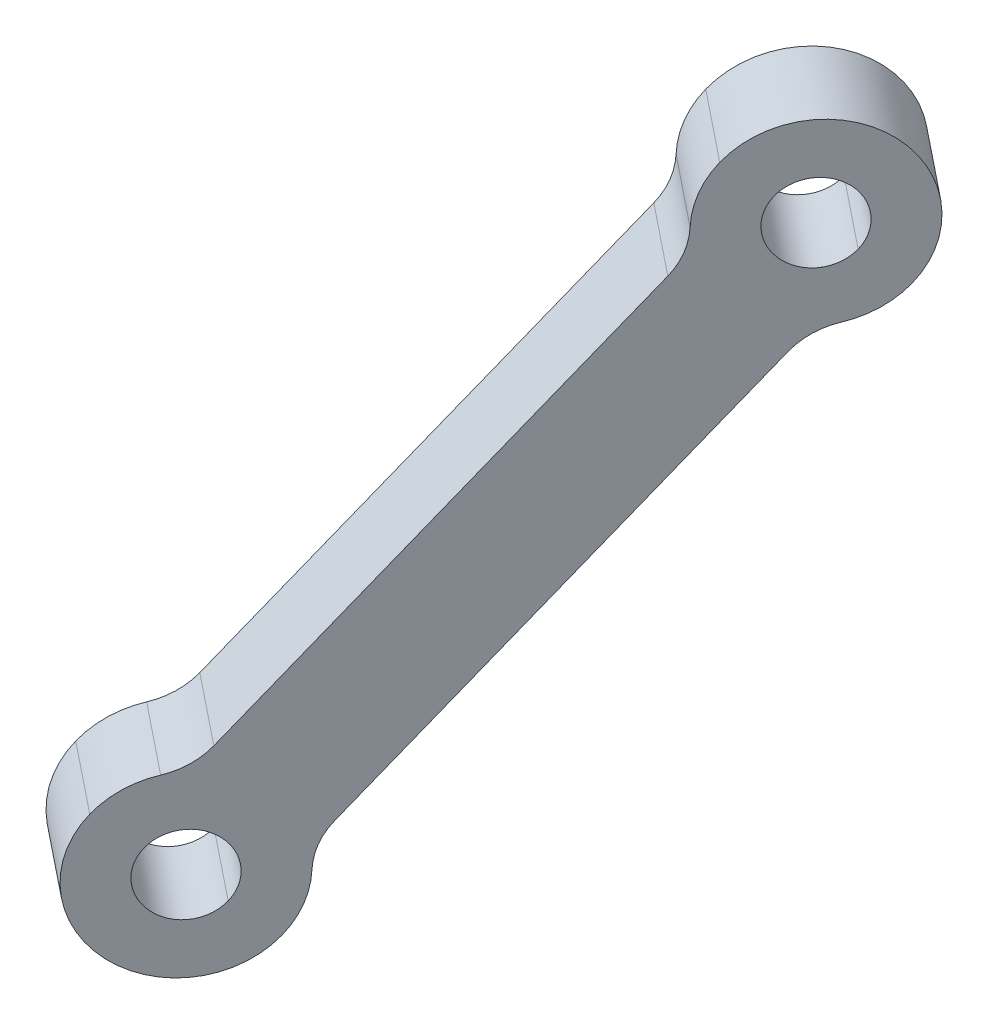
ISO-10303-21;
HEADER;
FILE_DESCRIPTION(('STEP AP214'),'2;1');
FILE_NAME('part.step','',(''),(''),'','','');
FILE_SCHEMA(('AUTOMOTIVE_DESIGN { 1 0 10303 214 1 1 1 1 }'));
ENDSEC;
DATA;
#1=APPLICATION_CONTEXT('core data for automotive mechanical design processes');
#2=APPLICATION_PROTOCOL_DEFINITION('international standard','automotive_design',2000,#1);
#3=PRODUCT_CONTEXT('',#1,'mechanical');
#4=PRODUCT('Part','Part','',(#3));
#5=PRODUCT_RELATED_PRODUCT_CATEGORY('part','',(#4));
#6=PRODUCT_DEFINITION_FORMATION('','',#4);
#7=PRODUCT_DEFINITION_CONTEXT('part definition',#1,'design');
#8=PRODUCT_DEFINITION('design','',#6,#7);
#9=PRODUCT_DEFINITION_SHAPE('','',#8);
#10=(LENGTH_UNIT() NAMED_UNIT(*) SI_UNIT(.MILLI.,.METRE.));
#11=(NAMED_UNIT(*) PLANE_ANGLE_UNIT() SI_UNIT($,.RADIAN.));
#12=(NAMED_UNIT(*) SI_UNIT($,.STERADIAN.) SOLID_ANGLE_UNIT());
#13=UNCERTAINTY_MEASURE_WITH_UNIT(LENGTH_MEASURE(1.E-05),#10,'distance_accuracy_value','');
#14=(GEOMETRIC_REPRESENTATION_CONTEXT(3) GLOBAL_UNCERTAINTY_ASSIGNED_CONTEXT((#13)) GLOBAL_UNIT_ASSIGNED_CONTEXT((#10,
#11,#12)) REPRESENTATION_CONTEXT('',''));
#15=CARTESIAN_POINT('',(0.,0.,0.));
#16=DIRECTION('',(0.,0.,1.));
#17=DIRECTION('',(1.,0.,0.));
#18=AXIS2_PLACEMENT_3D('',#15,#16,#17);
#19=CARTESIAN_POINT('',(203.284397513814,-38.0369694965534,187.431891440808));
#20=DIRECTION('',(-0.781080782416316,0.00440513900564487,-0.624414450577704));
#21=DIRECTION('',(0.475065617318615,-0.644779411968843,-0.598808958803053));
#22=AXIS2_PLACEMENT_3D('',#19,#20,#21);
#23=CYLINDRICAL_SURFACE('',#22,3.);
#24=CARTESIAN_POINT('',(203.284397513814,-38.0369694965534,187.431891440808));
#25=DIRECTION('',(-0.781080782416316,0.00440513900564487,-0.624414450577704));
#26=DIRECTION('',(-0.475065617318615,0.644779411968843,0.598808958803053));
#27=AXIS2_PLACEMENT_3D('',#24,#25,#26);
#28=CIRCLE('',#27,3.);
#29=CARTESIAN_POINT('',(201.859200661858,-36.1026312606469,189.228318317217));
#30=VERTEX_POINT('',#29);
#31=CARTESIAN_POINT('',(202.916645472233,-35.0986643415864,187.912642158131));
#32=VERTEX_POINT('',#31);
#33=EDGE_CURVE('E20',#30,#32,#28,.T.);
#34=ORIENTED_EDGE('',*,*,#33,.F.);
#35=DIRECTION('',(0.781080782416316,-0.00440513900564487,0.624414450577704));
#36=VECTOR('',#35,1.);
#37=CARTESIAN_POINT('',(201.859200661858,-36.1026312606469,189.228318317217));
#38=LINE('',#37,#36);
#39=CARTESIAN_POINT('',(198.734877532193,-36.0850107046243,186.730660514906));
#40=VERTEX_POINT('',#39);
#41=EDGE_CURVE('E83',#40,#30,#38,.T.);
#42=ORIENTED_EDGE('',*,*,#41,.F.);
#43=CARTESIAN_POINT('',(200.160074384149,-38.0193489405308,184.934233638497));
#44=DIRECTION('',(0.781080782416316,-0.00440513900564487,0.624414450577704));
#45=DIRECTION('',(-0.475065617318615,0.644779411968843,0.598808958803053));
#46=AXIS2_PLACEMENT_3D('',#43,#44,#45);
#47=CIRCLE('',#46,3.);
#48=CARTESIAN_POINT('',(199.792322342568,-35.0810437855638,185.41498435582));
#49=VERTEX_POINT('',#48);
#50=EDGE_CURVE('E27',#49,#40,#47,.T.);
#51=ORIENTED_EDGE('',*,*,#50,.F.);
#52=DIRECTION('',(-0.781080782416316,0.00440513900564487,-0.624414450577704));
#53=VECTOR('',#52,1.);
#54=CARTESIAN_POINT('',(202.916645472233,-35.0986643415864,187.912642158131));
#55=LINE('',#54,#53);
#56=EDGE_CURVE('E80',#32,#49,#55,.T.);
#57=ORIENTED_EDGE('',*,*,#56,.F.);
#58=EDGE_LOOP('',(#34,#42,#51,#57));
#59=FACE_BOUND('',#58,.T.);
#60=ADVANCED_FACE('F17',(#59),#23,.F.);
#61=CARTESIAN_POINT('',(194.231273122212,-55.1124885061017,198.635990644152));
#62=DIRECTION('',(-0.781080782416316,0.00440513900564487,-0.624414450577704));
#63=DIRECTION('',(0.475065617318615,-0.644779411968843,-0.598808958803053));
#64=AXIS2_PLACEMENT_3D('',#61,#62,#63);
#65=CYLINDRICAL_SURFACE('',#64,3.);
#66=CARTESIAN_POINT('',(194.231273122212,-55.1124885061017,198.635990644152));
#67=DIRECTION('',(-0.781080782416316,0.00440513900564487,-0.624414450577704));
#68=DIRECTION('',(-0.475065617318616,0.644779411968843,0.598808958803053));
#69=AXIS2_PLACEMENT_3D('',#66,#67,#68);
#70=CIRCLE('',#69,3.);
#71=CARTESIAN_POINT('',(192.35943011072,-55.0111192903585,200.9781964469));
#72=VERTEX_POINT('',#71);
#73=CARTESIAN_POINT('',(192.806076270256,-53.1781502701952,200.432417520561));
#74=VERTEX_POINT('',#73);
#75=EDGE_CURVE('E113',#72,#74,#70,.T.);
#76=ORIENTED_EDGE('',*,*,#75,.F.);
#77=DIRECTION('',(0.781080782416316,-0.00440513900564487,0.624414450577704));
#78=VECTOR('',#77,1.);
#79=CARTESIAN_POINT('',(192.35943011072,-55.0111192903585,200.9781964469));
#80=LINE('',#79,#78);
#81=CARTESIAN_POINT('',(189.235106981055,-54.993498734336,198.48053864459));
#82=VERTEX_POINT('',#81);
#83=EDGE_CURVE('E187',#82,#72,#80,.T.);
#84=ORIENTED_EDGE('',*,*,#83,.F.);
#85=CARTESIAN_POINT('',(191.106949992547,-55.0948679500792,196.138332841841));
#86=DIRECTION('',(0.781080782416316,-0.00440513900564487,0.624414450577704));
#87=DIRECTION('',(-0.475065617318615,0.644779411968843,0.598808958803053));
#88=AXIS2_PLACEMENT_3D('',#85,#86,#87);
#89=CIRCLE('',#88,3.);
#90=CARTESIAN_POINT('',(189.681753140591,-53.1605297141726,197.93475971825));
#91=VERTEX_POINT('',#90);
#92=EDGE_CURVE('E10',#91,#82,#89,.T.);
#93=ORIENTED_EDGE('',*,*,#92,.F.);
#94=DIRECTION('',(-0.781080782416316,0.00440513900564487,-0.624414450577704));
#95=VECTOR('',#94,1.);
#96=CARTESIAN_POINT('',(192.806076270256,-53.1781502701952,200.432417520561));
#97=LINE('',#96,#95);
#98=EDGE_CURVE('E167',#74,#91,#97,.T.);
#99=ORIENTED_EDGE('',*,*,#98,.F.);
#100=EDGE_LOOP('',(#76,#84,#93,#99));
#101=FACE_BOUND('',#100,.T.);
#102=ADVANCED_FACE('F394',(#101),#65,.F.);
#103=CARTESIAN_POINT('',(189.005551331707,-48.0199149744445,205.222889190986));
#104=DIRECTION('',(-0.781080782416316,0.00440513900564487,-0.624414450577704));
#105=DIRECTION('',(0.475065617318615,-0.644779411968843,-0.598808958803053));
#106=AXIS2_PLACEMENT_3D('',#103,#104,#105);
#107=CYLINDRICAL_SURFACE('',#106,3.);
#108=CARTESIAN_POINT('',(189.005551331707,-48.0199149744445,205.222889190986));
#109=DIRECTION('',(-0.781080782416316,0.00440513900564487,-0.624414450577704));
#110=DIRECTION('',(-0.475065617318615,0.644779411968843,0.598808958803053));
#111=AXIS2_PLACEMENT_3D('',#108,#109,#110);
#112=CIRCLE('',#111,3.);
#113=CARTESIAN_POINT('',(190.430748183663,-49.954253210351,203.426462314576));
#114=VERTEX_POINT('',#113);
#115=CARTESIAN_POINT('',(189.373303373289,-50.9582201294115,204.742138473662));
#116=VERTEX_POINT('',#115);
#117=EDGE_CURVE('E136',#114,#116,#112,.T.);
#118=ORIENTED_EDGE('',*,*,#117,.F.);
#119=DIRECTION('',(0.781080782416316,-0.00440513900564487,0.624414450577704));
#120=VECTOR('',#119,1.);
#121=CARTESIAN_POINT('',(190.430748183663,-49.954253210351,203.426462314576));
#122=LINE('',#121,#120);
#123=CARTESIAN_POINT('',(187.306425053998,-49.9366326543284,200.928804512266));
#124=VERTEX_POINT('',#123);
#125=EDGE_CURVE('E126',#124,#114,#122,.T.);
#126=ORIENTED_EDGE('',*,*,#125,.F.);
#127=CARTESIAN_POINT('',(185.881228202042,-48.0022944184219,202.725231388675));
#128=DIRECTION('',(0.781080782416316,-0.00440513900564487,0.624414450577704));
#129=DIRECTION('',(-0.475065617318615,0.644779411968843,0.598808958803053));
#130=AXIS2_PLACEMENT_3D('',#127,#128,#129);
#131=CIRCLE('',#130,3.);
#132=CARTESIAN_POINT('',(186.248980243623,-50.940599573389,202.244480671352));
#133=VERTEX_POINT('',#132);
#134=EDGE_CURVE('E42',#133,#124,#131,.T.);
#135=ORIENTED_EDGE('',*,*,#134,.F.);
#136=DIRECTION('',(-0.781080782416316,0.00440513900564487,-0.624414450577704));
#137=VECTOR('',#136,1.);
#138=CARTESIAN_POINT('',(189.373303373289,-50.9582201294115,204.742138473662));
#139=LINE('',#138,#137);
#140=EDGE_CURVE('E183',#116,#133,#139,.T.);
#141=ORIENTED_EDGE('',*,*,#140,.F.);
#142=EDGE_LOOP('',(#118,#126,#135,#141));
#143=FACE_BOUND('',#142,.T.);
#144=ADVANCED_FACE('F398',(#143),#107,.F.);
#145=CARTESIAN_POINT('',(198.05867572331,-30.9443959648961,194.018789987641));
#146=DIRECTION('',(-0.781080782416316,0.00440513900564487,-0.624414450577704));
#147=DIRECTION('',(0.475065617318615,-0.644779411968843,-0.598808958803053));
#148=AXIS2_PLACEMENT_3D('',#145,#146,#147);
#149=CYLINDRICAL_SURFACE('',#148,3.);
#150=CARTESIAN_POINT('',(198.05867572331,-30.9443959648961,194.018789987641));
#151=DIRECTION('',(-0.781080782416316,0.00440513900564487,-0.624414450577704));
#152=DIRECTION('',(-0.475065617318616,0.644779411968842,0.598808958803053));
#153=AXIS2_PLACEMENT_3D('',#150,#151,#152);
#154=CIRCLE('',#153,3.);
#155=CARTESIAN_POINT('',(199.930518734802,-31.0457651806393,191.676584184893));
#156=VERTEX_POINT('',#155);
#157=CARTESIAN_POINT('',(199.483872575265,-32.8787342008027,192.222363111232));
#158=VERTEX_POINT('',#157);
#159=EDGE_CURVE('E154',#156,#158,#154,.T.);
#160=ORIENTED_EDGE('',*,*,#159,.F.);
#161=DIRECTION('',(0.781080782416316,-0.00440513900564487,0.624414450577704));
#162=VECTOR('',#161,1.);
#163=CARTESIAN_POINT('',(199.930518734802,-31.0457651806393,191.676584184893));
#164=LINE('',#163,#162);
#165=CARTESIAN_POINT('',(196.806195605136,-31.0281446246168,189.178926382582));
#166=VERTEX_POINT('',#165);
#167=EDGE_CURVE('E234',#166,#156,#164,.T.);
#168=ORIENTED_EDGE('',*,*,#167,.F.);
#169=CARTESIAN_POINT('',(194.934352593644,-30.9267754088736,191.521132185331));
#170=DIRECTION('',(0.781080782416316,-0.00440513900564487,0.624414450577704));
#171=DIRECTION('',(-0.475065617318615,0.644779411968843,0.598808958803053));
#172=AXIS2_PLACEMENT_3D('',#169,#170,#171);
#173=CIRCLE('',#172,3.);
#174=CARTESIAN_POINT('',(196.3595494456,-32.8611136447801,189.724705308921));
#175=VERTEX_POINT('',#174);
#176=EDGE_CURVE('E87',#175,#166,#173,.T.);
#177=ORIENTED_EDGE('',*,*,#176,.F.);
#178=DIRECTION('',(-0.781080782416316,0.00440513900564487,-0.624414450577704));
#179=VECTOR('',#178,1.);
#180=CARTESIAN_POINT('',(196.3595494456,-32.8611136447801,189.724705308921));
#181=LINE('',#180,#179);
#182=EDGE_CURVE('E127',#158,#175,#181,.T.);
#183=ORIENTED_EDGE('',*,*,#182,.F.);
#184=EDGE_LOOP('',(#160,#168,#177,#183));
#185=FACE_BOUND('',#184,.T.);
#186=ADVANCED_FACE('F388',(#185),#149,.F.);
#187=CARTESIAN_POINT('',(199.301986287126,-31.1633035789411,186.055985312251));
#188=DIRECTION('',(0.781080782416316,-0.00440513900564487,0.624414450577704));
#189=DIRECTION('',(-0.405247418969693,-0.764356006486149,0.501532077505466));
#190=AXIS2_PLACEMENT_3D('',#187,#188,#189);
#191=PLANE('',#190);
#192=CARTESIAN_POINT('',(186.739316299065,-54.8583397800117,201.603479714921));
#193=DIRECTION('',(0.781080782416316,-0.00440513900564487,0.624414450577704));
#194=DIRECTION('',(-0.475065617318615,0.644779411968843,0.598808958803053));
#195=AXIS2_PLACEMENT_3D('',#192,#193,#194);
#196=CIRCLE('',#195,1.75);
#197=CARTESIAN_POINT('',(187.570681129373,-55.9867037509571,200.555564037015));
#198=VERTEX_POINT('',#197);
#199=CARTESIAN_POINT('',(185.907951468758,-53.7299758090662,202.651395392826));
#200=VERTEX_POINT('',#199);
#201=EDGE_CURVE('E265',#198,#200,#196,.T.);
#202=ORIENTED_EDGE('',*,*,#201,.T.);
#203=CARTESIAN_POINT('',(186.739316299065,-54.8583397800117,201.603479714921));
#204=DIRECTION('',(0.781080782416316,-0.00440513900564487,0.624414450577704));
#205=DIRECTION('',(-0.475065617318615,0.644779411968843,0.598808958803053));
#206=AXIS2_PLACEMENT_3D('',#203,#204,#205);
#207=CIRCLE('',#206,1.75);
#208=EDGE_CURVE('E133',#200,#198,#207,.T.);
#209=ORIENTED_EDGE('',*,*,#208,.T.);
#210=EDGE_LOOP('',(#202,#209));
#211=FACE_BOUND('',#210,.T.);
#212=CARTESIAN_POINT('',(199.301986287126,-31.1633035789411,186.055985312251));
#213=DIRECTION('',(0.781080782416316,-0.00440513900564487,0.624414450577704));
#214=DIRECTION('',(-0.475065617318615,0.644779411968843,0.598808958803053));
#215=AXIS2_PLACEMENT_3D('',#212,#213,#214);
#216=CIRCLE('',#215,1.75);
#217=CARTESIAN_POINT('',(200.133351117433,-32.2916675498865,185.008069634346));
#218=VERTEX_POINT('',#217);
#219=CARTESIAN_POINT('',(198.470621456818,-30.0349396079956,187.103900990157));
#220=VERTEX_POINT('',#219);
#221=EDGE_CURVE('E252',#218,#220,#216,.T.);
#222=ORIENTED_EDGE('',*,*,#221,.T.);
#223=CARTESIAN_POINT('',(199.301986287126,-31.1633035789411,186.055985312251));
#224=DIRECTION('',(0.781080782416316,-0.00440513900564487,0.624414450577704));
#225=DIRECTION('',(-0.475065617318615,0.644779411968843,0.598808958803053));
#226=AXIS2_PLACEMENT_3D('',#223,#224,#225);
#227=CIRCLE('',#226,1.75);
#228=EDGE_CURVE('E118',#220,#218,#227,.T.);
#229=ORIENTED_EDGE('',*,*,#228,.T.);
#230=EDGE_LOOP('',(#222,#229));
#231=FACE_BOUND('',#230,.T.);
#232=CARTESIAN_POINT('',(186.739316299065,-54.8583397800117,201.603479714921));
#233=DIRECTION('',(0.781080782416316,-0.00440513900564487,0.624414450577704));
#234=DIRECTION('',(-0.475065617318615,0.644779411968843,0.598808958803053));
#235=AXIS2_PLACEMENT_3D('',#232,#233,#234);
#236=CIRCLE('',#235,4.);
#237=CARTESIAN_POINT('',(184.839053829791,-52.2792221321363,203.998715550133));
#238=VERTEX_POINT('',#237);
#239=EDGE_CURVE('E176',#133,#238,#236,.T.);
#240=ORIENTED_EDGE('',*,*,#239,.F.);
#241=ORIENTED_EDGE('',*,*,#134,.T.);
#242=DIRECTION('',(-0.405247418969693,-0.764356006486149,0.501532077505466));
#243=VECTOR('',#242,1.);
#244=CARTESIAN_POINT('',(198.114322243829,-29.5513550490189,187.553007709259));
#245=LINE('',#244,#243);
#246=EDGE_CURVE('E123',#175,#124,#245,.T.);
#247=ORIENTED_EDGE('',*,*,#246,.F.);
#248=ORIENTED_EDGE('',*,*,#176,.T.);
#249=CARTESIAN_POINT('',(199.301986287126,-31.1633035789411,186.055985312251));
#250=DIRECTION('',(0.781080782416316,-0.00440513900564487,0.624414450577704));
#251=DIRECTION('',(-0.475065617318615,0.644779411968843,0.598808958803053));
#252=AXIS2_PLACEMENT_3D('',#249,#250,#251);
#253=CIRCLE('',#252,4.);
#254=CARTESIAN_POINT('',(197.401723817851,-28.5841859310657,188.451221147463));
#255=VERTEX_POINT('',#254);
#256=EDGE_CURVE('E230',#255,#166,#253,.T.);
#257=ORIENTED_EDGE('',*,*,#256,.F.);
#258=CARTESIAN_POINT('',(199.301986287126,-31.1633035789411,186.055985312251));
#259=DIRECTION('',(0.781080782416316,-0.00440513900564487,0.624414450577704));
#260=DIRECTION('',(-0.475065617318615,0.644779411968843,0.598808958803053));
#261=AXIS2_PLACEMENT_3D('',#258,#259,#260);
#262=CIRCLE('',#261,4.);
#263=CARTESIAN_POINT('',(201.2022487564,-33.7424212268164,183.660749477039));
#264=VERTEX_POINT('',#263);
#265=EDGE_CURVE('E96',#264,#255,#262,.T.);
#266=ORIENTED_EDGE('',*,*,#265,.F.);
#267=CARTESIAN_POINT('',(199.301986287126,-31.1633035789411,186.055985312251));
#268=DIRECTION('',(0.781080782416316,-0.00440513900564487,0.624414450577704));
#269=DIRECTION('',(-0.475065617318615,0.644779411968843,0.598808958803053));
#270=AXIS2_PLACEMENT_3D('',#267,#268,#269);
#271=CIRCLE('',#270,4.);
#272=EDGE_CURVE('E91',#49,#264,#271,.T.);
#273=ORIENTED_EDGE('',*,*,#272,.F.);
#274=ORIENTED_EDGE('',*,*,#50,.T.);
#275=DIRECTION('',(-0.405247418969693,-0.764356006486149,0.501532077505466));
#276=VECTOR('',#275,1.);
#277=CARTESIAN_POINT('',(200.489650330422,-32.7752521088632,184.558962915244));
#278=LINE('',#277,#276);
#279=EDGE_CURVE('E171',#40,#91,#278,.T.);
#280=ORIENTED_EDGE('',*,*,#279,.T.);
#281=ORIENTED_EDGE('',*,*,#92,.T.);
#282=CARTESIAN_POINT('',(186.739316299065,-54.8583397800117,201.603479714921));
#283=DIRECTION('',(0.781080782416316,-0.00440513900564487,0.624414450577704));
#284=DIRECTION('',(-0.475065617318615,0.644779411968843,0.598808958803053));
#285=AXIS2_PLACEMENT_3D('',#282,#283,#284);
#286=CIRCLE('',#285,4.);
#287=CARTESIAN_POINT('',(188.63957876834,-57.437457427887,199.208243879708));
#288=VERTEX_POINT('',#287);
#289=EDGE_CURVE('E191',#288,#82,#286,.T.);
#290=ORIENTED_EDGE('',*,*,#289,.F.);
#291=CARTESIAN_POINT('',(186.739316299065,-54.8583397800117,201.603479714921));
#292=DIRECTION('',(0.781080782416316,-0.00440513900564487,0.624414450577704));
#293=DIRECTION('',(-0.475065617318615,0.644779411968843,0.598808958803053));
#294=AXIS2_PLACEMENT_3D('',#291,#292,#293);
#295=CIRCLE('',#294,4.);
#296=EDGE_CURVE('E205',#238,#288,#295,.T.);
#297=ORIENTED_EDGE('',*,*,#296,.F.);
#298=EDGE_LOOP('',(#240,#241,#247,#248,#257,#266,#273,#274,#280,#281,#290,#297));
#299=FACE_BOUND('',#298,.T.);
#300=ADVANCED_FACE('F92',(#211,#231,#299),#191,.F.);
#301=CARTESIAN_POINT('',(202.426309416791,-31.1809241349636,188.553643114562));
#302=DIRECTION('',(0.781080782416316,-0.00440513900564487,0.624414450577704));
#303=DIRECTION('',(-0.405247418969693,-0.764356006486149,0.501532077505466));
#304=AXIS2_PLACEMENT_3D('',#301,#302,#303);
#305=PLANE('',#304);
#306=CARTESIAN_POINT('',(189.863639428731,-54.8759603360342,204.101137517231));
#307=DIRECTION('',(0.781080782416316,-0.00440513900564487,0.624414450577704));
#308=DIRECTION('',(-0.475065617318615,0.644779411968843,0.598808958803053));
#309=AXIS2_PLACEMENT_3D('',#306,#307,#308);
#310=CIRCLE('',#309,1.75);
#311=CARTESIAN_POINT('',(190.695004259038,-56.0043243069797,203.053221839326));
#312=VERTEX_POINT('',#311);
#313=CARTESIAN_POINT('',(189.032274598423,-53.7475963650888,205.149053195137));
#314=VERTEX_POINT('',#313);
#315=EDGE_CURVE('E278',#312,#314,#310,.T.);
#316=ORIENTED_EDGE('',*,*,#315,.F.);
#317=CARTESIAN_POINT('',(189.863639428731,-54.8759603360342,204.101137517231));
#318=DIRECTION('',(0.781080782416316,-0.00440513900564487,0.624414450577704));
#319=DIRECTION('',(-0.475065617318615,0.644779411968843,0.598808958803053));
#320=AXIS2_PLACEMENT_3D('',#317,#318,#319);
#321=CIRCLE('',#320,1.75);
#322=EDGE_CURVE('E129',#314,#312,#321,.T.);
#323=ORIENTED_EDGE('',*,*,#322,.F.);
#324=EDGE_LOOP('',(#316,#323));
#325=FACE_BOUND('',#324,.T.);
#326=CARTESIAN_POINT('',(202.426309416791,-31.1809241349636,188.553643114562));
#327=DIRECTION('',(0.781080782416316,-0.00440513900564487,0.624414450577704));
#328=DIRECTION('',(-0.475065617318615,0.644779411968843,0.598808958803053));
#329=AXIS2_PLACEMENT_3D('',#326,#327,#328);
#330=CIRCLE('',#329,1.75);
#331=CARTESIAN_POINT('',(203.257674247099,-32.3092881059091,187.505727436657));
#332=VERTEX_POINT('',#331);
#333=CARTESIAN_POINT('',(201.594944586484,-30.0525601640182,189.601558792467));
#334=VERTEX_POINT('',#333);
#335=EDGE_CURVE('E257',#332,#334,#330,.T.);
#336=ORIENTED_EDGE('',*,*,#335,.F.);
#337=CARTESIAN_POINT('',(202.426309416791,-31.1809241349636,188.553643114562));
#338=DIRECTION('',(0.781080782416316,-0.00440513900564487,0.624414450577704));
#339=DIRECTION('',(-0.475065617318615,0.644779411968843,0.598808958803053));
#340=AXIS2_PLACEMENT_3D('',#337,#338,#339);
#341=CIRCLE('',#340,1.75);
#342=EDGE_CURVE('E101',#334,#332,#341,.T.);
#343=ORIENTED_EDGE('',*,*,#342,.F.);
#344=EDGE_LOOP('',(#336,#343));
#345=FACE_BOUND('',#344,.T.);
#346=DIRECTION('',(-0.405247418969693,-0.764356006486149,0.501532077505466));
#347=VECTOR('',#346,1.);
#348=CARTESIAN_POINT('',(201.238645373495,-29.5689756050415,190.05066551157));
#349=LINE('',#348,#347);
#350=EDGE_CURVE('E122',#158,#114,#349,.T.);
#351=ORIENTED_EDGE('',*,*,#350,.T.);
#352=ORIENTED_EDGE('',*,*,#117,.T.);
#353=CARTESIAN_POINT('',(189.863639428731,-54.8759603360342,204.101137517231));
#354=DIRECTION('',(0.781080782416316,-0.00440513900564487,0.624414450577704));
#355=DIRECTION('',(-0.475065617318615,0.644779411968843,0.598808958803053));
#356=AXIS2_PLACEMENT_3D('',#353,#354,#355);
#357=CIRCLE('',#356,4.);
#358=CARTESIAN_POINT('',(187.963376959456,-52.2968426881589,206.496373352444));
#359=VERTEX_POINT('',#358);
#360=EDGE_CURVE('E184',#116,#359,#357,.T.);
#361=ORIENTED_EDGE('',*,*,#360,.T.);
#362=CARTESIAN_POINT('',(189.863639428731,-54.8759603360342,204.101137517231));
#363=DIRECTION('',(0.781080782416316,-0.00440513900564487,0.624414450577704));
#364=DIRECTION('',(-0.475065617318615,0.644779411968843,0.598808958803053));
#365=AXIS2_PLACEMENT_3D('',#362,#363,#364);
#366=CIRCLE('',#365,4.);
#367=CARTESIAN_POINT('',(191.763901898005,-57.4550779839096,201.705901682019));
#368=VERTEX_POINT('',#367);
#369=EDGE_CURVE('E213',#359,#368,#366,.T.);
#370=ORIENTED_EDGE('',*,*,#369,.T.);
#371=CARTESIAN_POINT('',(189.863639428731,-54.8759603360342,204.101137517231));
#372=DIRECTION('',(0.781080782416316,-0.00440513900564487,0.624414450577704));
#373=DIRECTION('',(-0.475065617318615,0.644779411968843,0.598808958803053));
#374=AXIS2_PLACEMENT_3D('',#371,#372,#373);
#375=CIRCLE('',#374,4.);
#376=EDGE_CURVE('E195',#368,#72,#375,.T.);
#377=ORIENTED_EDGE('',*,*,#376,.T.);
#378=ORIENTED_EDGE('',*,*,#75,.T.);
#379=DIRECTION('',(-0.405247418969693,-0.764356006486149,0.501532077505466));
#380=VECTOR('',#379,1.);
#381=CARTESIAN_POINT('',(203.613973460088,-32.7928726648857,187.056620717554));
#382=LINE('',#381,#380);
#383=EDGE_CURVE('E172',#30,#74,#382,.T.);
#384=ORIENTED_EDGE('',*,*,#383,.F.);
#385=ORIENTED_EDGE('',*,*,#33,.T.);
#386=CARTESIAN_POINT('',(202.426309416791,-31.1809241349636,188.553643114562));
#387=DIRECTION('',(0.781080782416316,-0.00440513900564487,0.624414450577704));
#388=DIRECTION('',(-0.475065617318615,0.644779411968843,0.598808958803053));
#389=AXIS2_PLACEMENT_3D('',#386,#387,#388);
#390=CIRCLE('',#389,4.);
#391=CARTESIAN_POINT('',(204.326571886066,-33.760041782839,186.15840727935));
#392=VERTEX_POINT('',#391);
#393=EDGE_CURVE('E104',#32,#392,#390,.T.);
#394=ORIENTED_EDGE('',*,*,#393,.T.);
#395=CARTESIAN_POINT('',(202.426309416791,-31.1809241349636,188.553643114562));
#396=DIRECTION('',(0.781080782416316,-0.00440513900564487,0.624414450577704));
#397=DIRECTION('',(-0.475065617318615,0.644779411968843,0.598808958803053));
#398=AXIS2_PLACEMENT_3D('',#395,#396,#397);
#399=CIRCLE('',#398,4.);
#400=CARTESIAN_POINT('',(200.526046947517,-28.6018064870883,190.948878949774));
#401=VERTEX_POINT('',#400);
#402=EDGE_CURVE('E224',#392,#401,#399,.T.);
#403=ORIENTED_EDGE('',*,*,#402,.T.);
#404=CARTESIAN_POINT('',(202.426309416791,-31.1809241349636,188.553643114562));
#405=DIRECTION('',(0.781080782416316,-0.00440513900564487,0.624414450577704));
#406=DIRECTION('',(-0.475065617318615,0.644779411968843,0.598808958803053));
#407=AXIS2_PLACEMENT_3D('',#404,#405,#406);
#408=CIRCLE('',#407,4.);
#409=EDGE_CURVE('E242',#401,#156,#408,.T.);
#410=ORIENTED_EDGE('',*,*,#409,.T.);
#411=ORIENTED_EDGE('',*,*,#159,.T.);
#412=EDGE_LOOP('',(#351,#352,#361,#370,#377,#378,#384,#385,#394,#403,#410,#411));
#413=FACE_BOUND('',#412,.T.);
#414=ADVANCED_FACE('F299',(#325,#345,#413),#305,.T.);
#415=CARTESIAN_POINT('',(189.863639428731,-54.8759603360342,204.101137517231));
#416=DIRECTION('',(-0.781080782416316,0.00440513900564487,-0.624414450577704));
#417=DIRECTION('',(0.475065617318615,-0.644779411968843,-0.598808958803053));
#418=AXIS2_PLACEMENT_3D('',#415,#416,#417);
#419=CYLINDRICAL_SURFACE('',#418,1.75);
#420=DIRECTION('',(-0.781080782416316,0.00440513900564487,-0.624414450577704));
#421=VECTOR('',#420,1.);
#422=CARTESIAN_POINT('',(189.032274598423,-53.7475963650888,205.149053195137));
#423=LINE('',#422,#421);
#424=EDGE_CURVE('E269',#314,#200,#423,.T.);
#425=ORIENTED_EDGE('',*,*,#424,.F.);
#426=ORIENTED_EDGE('',*,*,#322,.T.);
#427=DIRECTION('',(-0.781080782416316,0.00440513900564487,-0.624414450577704));
#428=VECTOR('',#427,1.);
#429=CARTESIAN_POINT('',(190.695004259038,-56.0043243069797,203.053221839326));
#430=LINE('',#429,#428);
#431=EDGE_CURVE('E261',#312,#198,#430,.T.);
#432=ORIENTED_EDGE('',*,*,#431,.T.);
#433=ORIENTED_EDGE('',*,*,#208,.F.);
#434=EDGE_LOOP('',(#425,#426,#432,#433));
#435=FACE_BOUND('',#434,.T.);
#436=ADVANCED_FACE('F379',(#435),#419,.F.);
#437=CARTESIAN_POINT('',(201.238645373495,-29.5689756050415,190.05066551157));
#438=DIRECTION('',(0.475065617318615,-0.644779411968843,-0.598808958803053));
#439=DIRECTION('',(-0.781080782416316,0.00440513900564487,-0.624414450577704));
#440=AXIS2_PLACEMENT_3D('',#437,#438,#439);
#441=PLANE('',#440);
#442=ORIENTED_EDGE('',*,*,#350,.F.);
#443=ORIENTED_EDGE('',*,*,#182,.T.);
#444=ORIENTED_EDGE('',*,*,#246,.T.);
#445=ORIENTED_EDGE('',*,*,#125,.T.);
#446=EDGE_LOOP('',(#442,#443,#444,#445));
#447=FACE_BOUND('',#446,.T.);
#448=ADVANCED_FACE('F386',(#447),#441,.F.);
#449=CARTESIAN_POINT('',(202.426309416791,-31.1809241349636,188.553643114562));
#450=DIRECTION('',(-0.781080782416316,0.00440513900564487,-0.624414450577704));
#451=DIRECTION('',(0.475065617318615,-0.644779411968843,-0.598808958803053));
#452=AXIS2_PLACEMENT_3D('',#449,#450,#451);
#453=CYLINDRICAL_SURFACE('',#452,1.75);
#454=DIRECTION('',(-0.781080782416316,0.00440513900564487,-0.624414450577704));
#455=VECTOR('',#454,1.);
#456=CARTESIAN_POINT('',(201.594944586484,-30.0525601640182,189.601558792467));
#457=LINE('',#456,#455);
#458=EDGE_CURVE('E256',#334,#220,#457,.T.);
#459=ORIENTED_EDGE('',*,*,#458,.F.);
#460=ORIENTED_EDGE('',*,*,#342,.T.);
#461=DIRECTION('',(-0.781080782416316,0.00440513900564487,-0.624414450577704));
#462=VECTOR('',#461,1.);
#463=CARTESIAN_POINT('',(203.257674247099,-32.3092881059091,187.505727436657));
#464=LINE('',#463,#462);
#465=EDGE_CURVE('E245',#332,#218,#464,.T.);
#466=ORIENTED_EDGE('',*,*,#465,.T.);
#467=ORIENTED_EDGE('',*,*,#228,.F.);
#468=EDGE_LOOP('',(#459,#460,#466,#467));
#469=FACE_BOUND('',#468,.T.);
#470=ADVANCED_FACE('F404',(#469),#453,.F.);
#471=CARTESIAN_POINT('',(202.426309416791,-31.1809241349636,188.553643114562));
#472=DIRECTION('',(-0.781080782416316,0.00440513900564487,-0.624414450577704));
#473=DIRECTION('',(0.475065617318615,-0.644779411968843,-0.598808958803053));
#474=AXIS2_PLACEMENT_3D('',#471,#472,#473);
#475=CYLINDRICAL_SURFACE('',#474,4.);
#476=DIRECTION('',(-0.781080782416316,0.00440513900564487,-0.624414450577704));
#477=VECTOR('',#476,1.);
#478=CARTESIAN_POINT('',(204.326571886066,-33.760041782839,186.15840727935));
#479=LINE('',#478,#477);
#480=EDGE_CURVE('E221',#392,#264,#479,.T.);
#481=ORIENTED_EDGE('',*,*,#480,.F.);
#482=ORIENTED_EDGE('',*,*,#393,.F.);
#483=ORIENTED_EDGE('',*,*,#56,.T.);
#484=ORIENTED_EDGE('',*,*,#272,.T.);
#485=EDGE_LOOP('',(#481,#482,#483,#484));
#486=FACE_BOUND('',#485,.T.);
#487=ADVANCED_FACE('F103',(#486),#475,.T.);
#488=CARTESIAN_POINT('',(203.613973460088,-32.7928726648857,187.056620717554));
#489=DIRECTION('',(0.475065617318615,-0.644779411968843,-0.598808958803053));
#490=DIRECTION('',(-0.781080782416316,0.00440513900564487,-0.624414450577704));
#491=AXIS2_PLACEMENT_3D('',#488,#489,#490);
#492=PLANE('',#491);
#493=ORIENTED_EDGE('',*,*,#383,.T.);
#494=ORIENTED_EDGE('',*,*,#98,.T.);
#495=ORIENTED_EDGE('',*,*,#279,.F.);
#496=ORIENTED_EDGE('',*,*,#41,.T.);
#497=EDGE_LOOP('',(#493,#494,#495,#496));
#498=FACE_BOUND('',#497,.T.);
#499=ADVANCED_FACE('F376',(#498),#492,.T.);
#500=CARTESIAN_POINT('',(189.863639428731,-54.8759603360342,204.101137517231));
#501=DIRECTION('',(-0.781080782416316,0.00440513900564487,-0.624414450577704));
#502=DIRECTION('',(0.475065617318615,-0.644779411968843,-0.598808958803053));
#503=AXIS2_PLACEMENT_3D('',#500,#501,#502);
#504=CYLINDRICAL_SURFACE('',#503,4.);
#505=DIRECTION('',(-0.781080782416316,0.00440513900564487,-0.624414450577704));
#506=VECTOR('',#505,1.);
#507=CARTESIAN_POINT('',(187.963376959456,-52.2968426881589,206.496373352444));
#508=LINE('',#507,#506);
#509=EDGE_CURVE('E209',#359,#238,#508,.T.);
#510=ORIENTED_EDGE('',*,*,#509,.F.);
#511=ORIENTED_EDGE('',*,*,#360,.F.);
#512=ORIENTED_EDGE('',*,*,#140,.T.);
#513=ORIENTED_EDGE('',*,*,#239,.T.);
#514=EDGE_LOOP('',(#510,#511,#512,#513));
#515=FACE_BOUND('',#514,.T.);
#516=ADVANCED_FACE('F444',(#515),#504,.T.);
#517=CARTESIAN_POINT('',(189.863639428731,-54.8759603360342,204.101137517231));
#518=DIRECTION('',(-0.781080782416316,0.00440513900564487,-0.624414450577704));
#519=DIRECTION('',(0.475065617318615,-0.644779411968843,-0.598808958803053));
#520=AXIS2_PLACEMENT_3D('',#517,#518,#519);
#521=CYLINDRICAL_SURFACE('',#520,4.);
#522=ORIENTED_EDGE('',*,*,#376,.F.);
#523=DIRECTION('',(-0.781080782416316,0.00440513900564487,-0.624414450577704));
#524=VECTOR('',#523,1.);
#525=CARTESIAN_POINT('',(191.763901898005,-57.4550779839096,201.705901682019));
#526=LINE('',#525,#524);
#527=EDGE_CURVE('E201',#368,#288,#526,.T.);
#528=ORIENTED_EDGE('',*,*,#527,.T.);
#529=ORIENTED_EDGE('',*,*,#289,.T.);
#530=ORIENTED_EDGE('',*,*,#83,.T.);
#531=EDGE_LOOP('',(#522,#528,#529,#530));
#532=FACE_BOUND('',#531,.T.);
#533=ADVANCED_FACE('F437',(#532),#521,.T.);
#534=CARTESIAN_POINT('',(189.863639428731,-54.8759603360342,204.101137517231));
#535=DIRECTION('',(-0.781080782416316,0.00440513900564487,-0.624414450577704));
#536=DIRECTION('',(0.475065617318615,-0.644779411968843,-0.598808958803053));
#537=AXIS2_PLACEMENT_3D('',#534,#535,#536);
#538=CYLINDRICAL_SURFACE('',#537,4.);
#539=ORIENTED_EDGE('',*,*,#369,.F.);
#540=ORIENTED_EDGE('',*,*,#509,.T.);
#541=ORIENTED_EDGE('',*,*,#296,.T.);
#542=ORIENTED_EDGE('',*,*,#527,.F.);
#543=EDGE_LOOP('',(#539,#540,#541,#542));
#544=FACE_BOUND('',#543,.T.);
#545=ADVANCED_FACE('F434',(#544),#538,.T.);
#546=CARTESIAN_POINT('',(202.426309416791,-31.1809241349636,188.553643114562));
#547=DIRECTION('',(-0.781080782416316,0.00440513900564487,-0.624414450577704));
#548=DIRECTION('',(0.475065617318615,-0.644779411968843,-0.598808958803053));
#549=AXIS2_PLACEMENT_3D('',#546,#547,#548);
#550=CYLINDRICAL_SURFACE('',#549,4.);
#551=DIRECTION('',(-0.781080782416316,0.00440513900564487,-0.624414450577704));
#552=VECTOR('',#551,1.);
#553=CARTESIAN_POINT('',(200.526046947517,-28.6018064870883,190.948878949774));
#554=LINE('',#553,#552);
#555=EDGE_CURVE('E235',#401,#255,#554,.T.);
#556=ORIENTED_EDGE('',*,*,#555,.F.);
#557=ORIENTED_EDGE('',*,*,#402,.F.);
#558=ORIENTED_EDGE('',*,*,#480,.T.);
#559=ORIENTED_EDGE('',*,*,#265,.T.);
#560=EDGE_LOOP('',(#556,#557,#558,#559));
#561=FACE_BOUND('',#560,.T.);
#562=ADVANCED_FACE('F429',(#561),#550,.T.);
#563=CARTESIAN_POINT('',(202.426309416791,-31.1809241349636,188.553643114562));
#564=DIRECTION('',(-0.781080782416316,0.00440513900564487,-0.624414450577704));
#565=DIRECTION('',(0.475065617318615,-0.644779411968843,-0.598808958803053));
#566=AXIS2_PLACEMENT_3D('',#563,#564,#565);
#567=CYLINDRICAL_SURFACE('',#566,4.);
#568=ORIENTED_EDGE('',*,*,#409,.F.);
#569=ORIENTED_EDGE('',*,*,#555,.T.);
#570=ORIENTED_EDGE('',*,*,#256,.T.);
#571=ORIENTED_EDGE('',*,*,#167,.T.);
#572=EDGE_LOOP('',(#568,#569,#570,#571));
#573=FACE_BOUND('',#572,.T.);
#574=ADVANCED_FACE('F422',(#573),#567,.T.);
#575=CARTESIAN_POINT('',(202.426309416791,-31.1809241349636,188.553643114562));
#576=DIRECTION('',(-0.781080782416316,0.00440513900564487,-0.624414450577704));
#577=DIRECTION('',(0.475065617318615,-0.644779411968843,-0.598808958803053));
#578=AXIS2_PLACEMENT_3D('',#575,#576,#577);
#579=CYLINDRICAL_SURFACE('',#578,1.75);
#580=ORIENTED_EDGE('',*,*,#335,.T.);
#581=ORIENTED_EDGE('',*,*,#458,.T.);
#582=ORIENTED_EDGE('',*,*,#221,.F.);
#583=ORIENTED_EDGE('',*,*,#465,.F.);
#584=EDGE_LOOP('',(#580,#581,#582,#583));
#585=FACE_BOUND('',#584,.T.);
#586=ADVANCED_FACE('F419',(#585),#579,.F.);
#587=CARTESIAN_POINT('',(189.863639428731,-54.8759603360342,204.101137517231));
#588=DIRECTION('',(-0.781080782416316,0.00440513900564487,-0.624414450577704));
#589=DIRECTION('',(0.475065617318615,-0.644779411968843,-0.598808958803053));
#590=AXIS2_PLACEMENT_3D('',#587,#588,#589);
#591=CYLINDRICAL_SURFACE('',#590,1.75);
#592=ORIENTED_EDGE('',*,*,#315,.T.);
#593=ORIENTED_EDGE('',*,*,#424,.T.);
#594=ORIENTED_EDGE('',*,*,#201,.F.);
#595=ORIENTED_EDGE('',*,*,#431,.F.);
#596=EDGE_LOOP('',(#592,#593,#594,#595));
#597=FACE_BOUND('',#596,.T.);
#598=ADVANCED_FACE('F290',(#597),#591,.F.);
#599=CLOSED_SHELL('',(#60,#102,#144,#186,#300,#414,#436,#448,#470,#487,#499,#516,#533,#545,#562,
#574,#586,#598));
#600=MANIFOLD_SOLID_BREP('B1',#599);
#601=ADVANCED_BREP_SHAPE_REPRESENTATION('',(#18,#600),#14);
#602=SHAPE_DEFINITION_REPRESENTATION(#9,#601);
ENDSEC;
END-ISO-10303-21;
